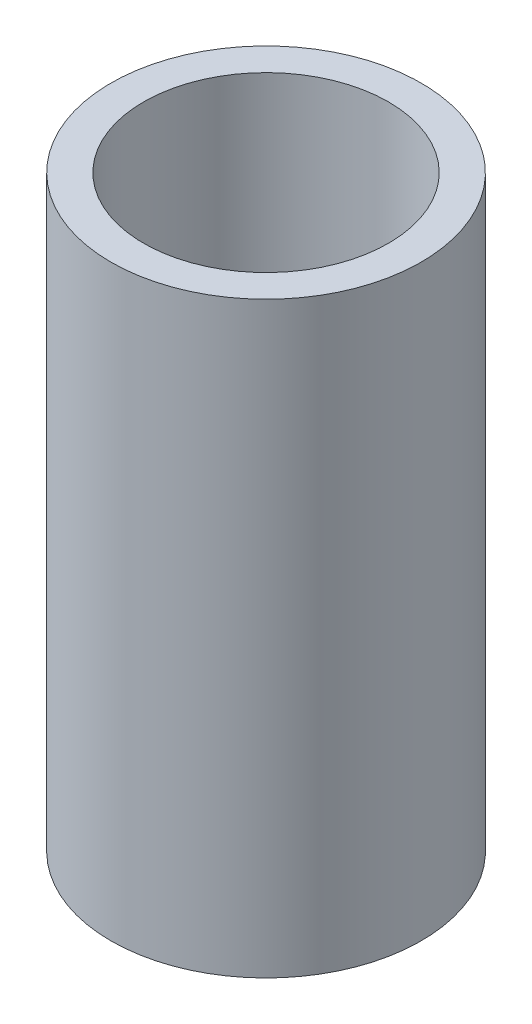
ISO-10303-21;
HEADER;
FILE_DESCRIPTION(('STEP AP214'),'2;1');
FILE_NAME('part.step','',(''),(''),'','','');
FILE_SCHEMA(('AUTOMOTIVE_DESIGN { 1 0 10303 214 1 1 1 1 }'));
ENDSEC;
DATA;
#1=APPLICATION_CONTEXT('core data for automotive mechanical design processes');
#2=APPLICATION_PROTOCOL_DEFINITION('international standard','automotive_design',2000,#1);
#3=PRODUCT_CONTEXT('',#1,'mechanical');
#4=PRODUCT('Part','Part','',(#3));
#5=PRODUCT_RELATED_PRODUCT_CATEGORY('part','',(#4));
#6=PRODUCT_DEFINITION_FORMATION('','',#4);
#7=PRODUCT_DEFINITION_CONTEXT('part definition',#1,'design');
#8=PRODUCT_DEFINITION('design','',#6,#7);
#9=PRODUCT_DEFINITION_SHAPE('','',#8);
#10=(LENGTH_UNIT() NAMED_UNIT(*) SI_UNIT(.MILLI.,.METRE.));
#11=(NAMED_UNIT(*) PLANE_ANGLE_UNIT() SI_UNIT($,.RADIAN.));
#12=(NAMED_UNIT(*) SI_UNIT($,.STERADIAN.) SOLID_ANGLE_UNIT());
#13=UNCERTAINTY_MEASURE_WITH_UNIT(LENGTH_MEASURE(1.E-05),#10,'distance_accuracy_value','');
#14=(GEOMETRIC_REPRESENTATION_CONTEXT(3) GLOBAL_UNCERTAINTY_ASSIGNED_CONTEXT((#13)) GLOBAL_UNIT_ASSIGNED_CONTEXT((#10,
#11,#12)) REPRESENTATION_CONTEXT('',''));
#15=CARTESIAN_POINT('',(0.,0.,0.));
#16=DIRECTION('',(0.,0.,1.));
#17=DIRECTION('',(1.,0.,0.));
#18=AXIS2_PLACEMENT_3D('',#15,#16,#17);
#19=CARTESIAN_POINT('',(0.,114.3,0.));
#20=DIRECTION('',(0.,-1.,0.));
#21=DIRECTION('',(0.,0.,-1.));
#22=AXIS2_PLACEMENT_3D('',#19,#20,#21);
#23=CYLINDRICAL_SURFACE('',#22,30.1625);
#24=CARTESIAN_POINT('',(0.,114.3,0.));
#25=DIRECTION('',(0.,1.,0.));
#26=DIRECTION('',(0.,0.,1.));
#27=AXIS2_PLACEMENT_3D('',#24,#25,#26);
#28=CIRCLE('',#27,30.1625);
#29=CARTESIAN_POINT('',(0.,114.3,30.1625));
#30=VERTEX_POINT('',#29);
#31=EDGE_CURVE('E10',#30,#30,#28,.T.);
#32=ORIENTED_EDGE('',*,*,#31,.F.);
#33=EDGE_LOOP('',(#32));
#34=FACE_BOUND('',#33,.T.);
#35=CARTESIAN_POINT('',(0.,0.,0.));
#36=DIRECTION('',(0.,1.,0.));
#37=DIRECTION('',(0.,0.,1.));
#38=AXIS2_PLACEMENT_3D('',#35,#36,#37);
#39=CIRCLE('',#38,30.1625);
#40=CARTESIAN_POINT('',(0.,0.,30.1625));
#41=VERTEX_POINT('',#40);
#42=EDGE_CURVE('E31',#41,#41,#39,.T.);
#43=ORIENTED_EDGE('',*,*,#42,.T.);
#44=EDGE_LOOP('',(#43));
#45=FACE_BOUND('',#44,.T.);
#46=ADVANCED_FACE('F28',(#34,#45),#23,.T.);
#47=CARTESIAN_POINT('',(0.,114.3,0.));
#48=DIRECTION('',(0.,1.,0.));
#49=DIRECTION('',(0.,0.,1.));
#50=AXIS2_PLACEMENT_3D('',#47,#48,#49);
#51=PLANE('',#50);
#52=CARTESIAN_POINT('',(0.,114.3,0.));
#53=DIRECTION('',(0.,-1.,0.));
#54=DIRECTION('',(0.,0.,-1.));
#55=AXIS2_PLACEMENT_3D('',#52,#53,#54);
#56=CIRCLE('',#55,23.8125);
#57=CARTESIAN_POINT('',(0.,114.3,-23.8125));
#58=VERTEX_POINT('',#57);
#59=EDGE_CURVE('E38',#58,#58,#56,.T.);
#60=ORIENTED_EDGE('',*,*,#59,.T.);
#61=EDGE_LOOP('',(#60));
#62=FACE_BOUND('',#61,.T.);
#63=ORIENTED_EDGE('',*,*,#31,.T.);
#64=EDGE_LOOP('',(#63));
#65=FACE_BOUND('',#64,.T.);
#66=ADVANCED_FACE('F46',(#62,#65),#51,.T.);
#67=CARTESIAN_POINT('',(0.,0.,0.));
#68=DIRECTION('',(0.,1.,0.));
#69=DIRECTION('',(0.,0.,1.));
#70=AXIS2_PLACEMENT_3D('',#67,#68,#69);
#71=PLANE('',#70);
#72=CARTESIAN_POINT('',(0.,0.,0.));
#73=DIRECTION('',(0.,-1.,0.));
#74=DIRECTION('',(0.,0.,-1.));
#75=AXIS2_PLACEMENT_3D('',#72,#73,#74);
#76=CIRCLE('',#75,23.8125);
#77=CARTESIAN_POINT('',(0.,0.,-23.8125));
#78=VERTEX_POINT('',#77);
#79=EDGE_CURVE('E40',#78,#78,#76,.T.);
#80=ORIENTED_EDGE('',*,*,#79,.F.);
#81=EDGE_LOOP('',(#80));
#82=FACE_BOUND('',#81,.T.);
#83=ORIENTED_EDGE('',*,*,#42,.F.);
#84=EDGE_LOOP('',(#83));
#85=FACE_BOUND('',#84,.T.);
#86=ADVANCED_FACE('F51',(#82,#85),#71,.F.);
#87=CARTESIAN_POINT('',(0.,114.3,0.));
#88=DIRECTION('',(0.,-1.,0.));
#89=DIRECTION('',(0.,0.,-1.));
#90=AXIS2_PLACEMENT_3D('',#87,#88,#89);
#91=CYLINDRICAL_SURFACE('',#90,23.8125);
#92=ORIENTED_EDGE('',*,*,#59,.F.);
#93=EDGE_LOOP('',(#92));
#94=FACE_BOUND('',#93,.T.);
#95=ORIENTED_EDGE('',*,*,#79,.T.);
#96=EDGE_LOOP('',(#95));
#97=FACE_BOUND('',#96,.T.);
#98=ADVANCED_FACE('F48',(#94,#97),#91,.F.);
#99=CLOSED_SHELL('',(#46,#66,#86,#98));
#100=MANIFOLD_SOLID_BREP('B2',#99);
#101=ADVANCED_BREP_SHAPE_REPRESENTATION('',(#18,#100),#14);
#102=SHAPE_DEFINITION_REPRESENTATION(#9,#101);
ENDSEC;
END-ISO-10303-21;
